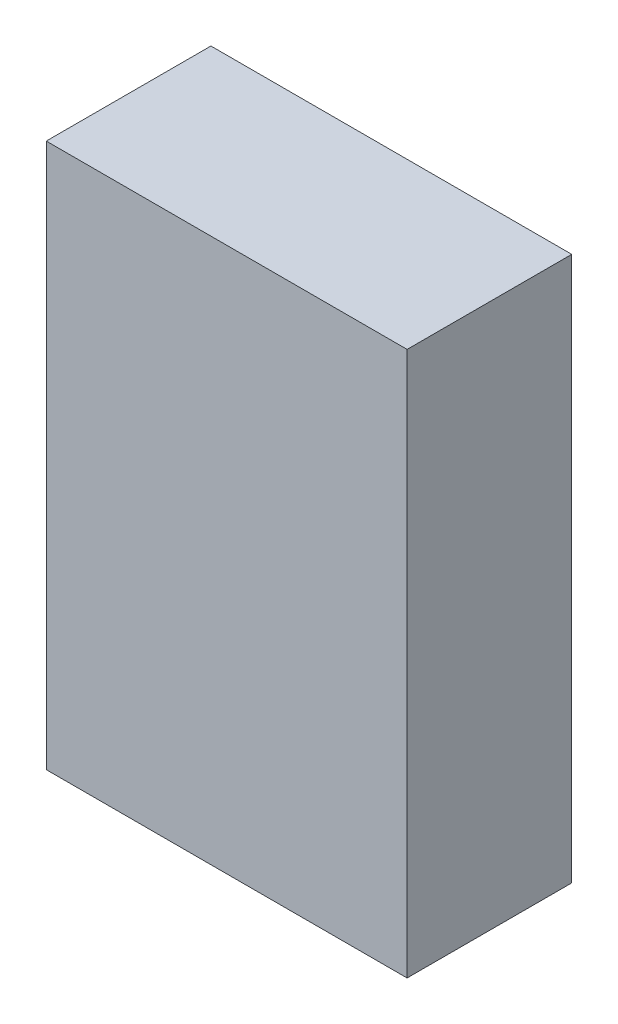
ISO-10303-21;
HEADER;
FILE_DESCRIPTION(('STEP AP214'),'2;1');
FILE_NAME('part.step','',(''),(''),'','','');
FILE_SCHEMA(('AUTOMOTIVE_DESIGN { 1 0 10303 214 1 1 1 1 }'));
ENDSEC;
DATA;
#1=APPLICATION_CONTEXT('core data for automotive mechanical design processes');
#2=APPLICATION_PROTOCOL_DEFINITION('international standard','automotive_design',2000,#1);
#3=PRODUCT_CONTEXT('',#1,'mechanical');
#4=PRODUCT('Part','Part','',(#3));
#5=PRODUCT_RELATED_PRODUCT_CATEGORY('part','',(#4));
#6=PRODUCT_DEFINITION_FORMATION('','',#4);
#7=PRODUCT_DEFINITION_CONTEXT('part definition',#1,'design');
#8=PRODUCT_DEFINITION('design','',#6,#7);
#9=PRODUCT_DEFINITION_SHAPE('','',#8);
#10=(LENGTH_UNIT() NAMED_UNIT(*) SI_UNIT(.MILLI.,.METRE.));
#11=(NAMED_UNIT(*) PLANE_ANGLE_UNIT() SI_UNIT($,.RADIAN.));
#12=(NAMED_UNIT(*) SI_UNIT($,.STERADIAN.) SOLID_ANGLE_UNIT());
#13=UNCERTAINTY_MEASURE_WITH_UNIT(LENGTH_MEASURE(1.E-05),#10,'distance_accuracy_value','');
#14=(GEOMETRIC_REPRESENTATION_CONTEXT(3) GLOBAL_UNCERTAINTY_ASSIGNED_CONTEXT((#13)) GLOBAL_UNIT_ASSIGNED_CONTEXT((#10,
#11,#12)) REPRESENTATION_CONTEXT('',''));
#15=CARTESIAN_POINT('',(0.,0.,0.));
#16=DIRECTION('',(0.,0.,1.));
#17=DIRECTION('',(1.,0.,0.));
#18=AXIS2_PLACEMENT_3D('',#15,#16,#17);
#19=CARTESIAN_POINT('',(-125.689752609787,-340.822154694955,-556.7));
#20=DIRECTION('',(-1.,0.,0.));
#21=DIRECTION('',(0.,0.,1.));
#22=AXIS2_PLACEMENT_3D('',#19,#20,#21);
#23=PLANE('',#22);
#24=DIRECTION('',(0.,-1.,0.));
#25=VECTOR('',#24,1.);
#26=CARTESIAN_POINT('',(-125.689752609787,-340.822154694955,0.));
#27=LINE('',#26,#25);
#28=CARTESIAN_POINT('',(-125.689752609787,1499.82657299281,0.));
#29=VERTEX_POINT('',#28);
#30=CARTESIAN_POINT('',(-125.689752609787,-340.822154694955,0.));
#31=VERTEX_POINT('',#30);
#32=EDGE_CURVE('E215',#29,#31,#27,.T.);
#33=ORIENTED_EDGE('',*,*,#32,.F.);
#34=DIRECTION('',(0.,0.,1.));
#35=VECTOR('',#34,1.);
#36=CARTESIAN_POINT('',(-125.689752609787,1499.82657299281,-556.7));
#37=LINE('',#36,#35);
#38=CARTESIAN_POINT('',(-125.689752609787,1499.82657299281,-556.7));
#39=VERTEX_POINT('',#38);
#40=EDGE_CURVE('E14',#39,#29,#37,.T.);
#41=ORIENTED_EDGE('',*,*,#40,.F.);
#42=DIRECTION('',(0.,-1.,0.));
#43=VECTOR('',#42,1.);
#44=CARTESIAN_POINT('',(-125.689752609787,-340.822154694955,-556.7));
#45=LINE('',#44,#43);
#46=CARTESIAN_POINT('',(-125.689752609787,-340.822154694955,-556.7));
#47=VERTEX_POINT('',#46);
#48=EDGE_CURVE('E217',#39,#47,#45,.T.);
#49=ORIENTED_EDGE('',*,*,#48,.T.);
#50=DIRECTION('',(0.,0.,1.));
#51=VECTOR('',#50,1.);
#52=CARTESIAN_POINT('',(-125.689752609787,-340.822154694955,-556.7));
#53=LINE('',#52,#51);
#54=EDGE_CURVE('E178',#47,#31,#53,.T.);
#55=ORIENTED_EDGE('',*,*,#54,.T.);
#56=EDGE_LOOP('',(#33,#41,#49,#55));
#57=FACE_BOUND('',#56,.T.);
#58=ADVANCED_FACE('F174',(#57),#23,.T.);
#59=CARTESIAN_POINT('',(-125.689752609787,1499.82657299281,-556.7));
#60=DIRECTION('',(0.,1.,0.));
#61=DIRECTION('',(0.,0.,1.));
#62=AXIS2_PLACEMENT_3D('',#59,#60,#61);
#63=PLANE('',#62);
#64=DIRECTION('',(-1.,0.,0.));
#65=VECTOR('',#64,1.);
#66=CARTESIAN_POINT('',(-125.689752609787,1499.82657299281,0.));
#67=LINE('',#66,#65);
#68=CARTESIAN_POINT('',(1094.33648617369,1499.82657299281,0.));
#69=VERTEX_POINT('',#68);
#70=EDGE_CURVE('E231',#69,#29,#67,.T.);
#71=ORIENTED_EDGE('',*,*,#70,.F.);
#72=DIRECTION('',(0.,0.,1.));
#73=VECTOR('',#72,1.);
#74=CARTESIAN_POINT('',(1094.33648617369,1499.82657299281,-556.7));
#75=LINE('',#74,#73);
#76=CARTESIAN_POINT('',(1094.33648617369,1499.82657299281,-556.7));
#77=VERTEX_POINT('',#76);
#78=EDGE_CURVE('E183',#77,#69,#75,.T.);
#79=ORIENTED_EDGE('',*,*,#78,.F.);
#80=DIRECTION('',(-1.,0.,0.));
#81=VECTOR('',#80,1.);
#82=CARTESIAN_POINT('',(-125.689752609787,1499.82657299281,-556.7));
#83=LINE('',#82,#81);
#84=EDGE_CURVE('E222',#77,#39,#83,.T.);
#85=ORIENTED_EDGE('',*,*,#84,.T.);
#86=ORIENTED_EDGE('',*,*,#40,.T.);
#87=EDGE_LOOP('',(#71,#79,#85,#86));
#88=FACE_BOUND('',#87,.T.);
#89=ADVANCED_FACE('F246',(#88),#63,.T.);
#90=CARTESIAN_POINT('',(1094.33648617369,-340.822154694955,-556.7));
#91=DIRECTION('',(1.,0.,0.));
#92=DIRECTION('',(0.,0.,-1.));
#93=AXIS2_PLACEMENT_3D('',#90,#91,#92);
#94=PLANE('',#93);
#95=DIRECTION('',(0.,1.,0.));
#96=VECTOR('',#95,1.);
#97=CARTESIAN_POINT('',(1094.33648617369,-340.822154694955,0.));
#98=LINE('',#97,#96);
#99=CARTESIAN_POINT('',(1094.33648617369,-340.822154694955,0.));
#100=VERTEX_POINT('',#99);
#101=EDGE_CURVE('E229',#100,#69,#98,.T.);
#102=ORIENTED_EDGE('',*,*,#101,.F.);
#103=DIRECTION('',(0.,0.,1.));
#104=VECTOR('',#103,1.);
#105=CARTESIAN_POINT('',(1094.33648617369,-340.822154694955,-556.7));
#106=LINE('',#105,#104);
#107=CARTESIAN_POINT('',(1094.33648617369,-340.822154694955,-556.7));
#108=VERTEX_POINT('',#107);
#109=EDGE_CURVE('E221',#108,#100,#106,.T.);
#110=ORIENTED_EDGE('',*,*,#109,.F.);
#111=DIRECTION('',(0.,1.,0.));
#112=VECTOR('',#111,1.);
#113=CARTESIAN_POINT('',(1094.33648617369,-340.822154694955,-556.7));
#114=LINE('',#113,#112);
#115=EDGE_CURVE('E239',#108,#77,#114,.T.);
#116=ORIENTED_EDGE('',*,*,#115,.T.);
#117=ORIENTED_EDGE('',*,*,#78,.T.);
#118=EDGE_LOOP('',(#102,#110,#116,#117));
#119=FACE_BOUND('',#118,.T.);
#120=ADVANCED_FACE('F243',(#119),#94,.T.);
#121=CARTESIAN_POINT('',(-125.689752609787,-340.822154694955,-556.7));
#122=DIRECTION('',(0.,-1.,0.));
#123=DIRECTION('',(0.,0.,-1.));
#124=AXIS2_PLACEMENT_3D('',#121,#122,#123);
#125=PLANE('',#124);
#126=DIRECTION('',(1.,0.,0.));
#127=VECTOR('',#126,1.);
#128=CARTESIAN_POINT('',(-125.689752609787,-340.822154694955,0.));
#129=LINE('',#128,#127);
#130=EDGE_CURVE('E224',#31,#100,#129,.T.);
#131=ORIENTED_EDGE('',*,*,#130,.F.);
#132=ORIENTED_EDGE('',*,*,#54,.F.);
#133=DIRECTION('',(1.,0.,0.));
#134=VECTOR('',#133,1.);
#135=CARTESIAN_POINT('',(-125.689752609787,-340.822154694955,-556.7));
#136=LINE('',#135,#134);
#137=EDGE_CURVE('E237',#47,#108,#136,.T.);
#138=ORIENTED_EDGE('',*,*,#137,.T.);
#139=ORIENTED_EDGE('',*,*,#109,.T.);
#140=EDGE_LOOP('',(#131,#132,#138,#139));
#141=FACE_BOUND('',#140,.T.);
#142=ADVANCED_FACE('F225',(#141),#125,.T.);
#143=CARTESIAN_POINT('',(-125.689752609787,1499.82657299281,-556.7));
#144=DIRECTION('',(0.,0.,-1.));
#145=DIRECTION('',(-1.,0.,0.));
#146=AXIS2_PLACEMENT_3D('',#143,#144,#145);
#147=PLANE('',#146);
#148=ORIENTED_EDGE('',*,*,#48,.F.);
#149=ORIENTED_EDGE('',*,*,#84,.F.);
#150=ORIENTED_EDGE('',*,*,#115,.F.);
#151=ORIENTED_EDGE('',*,*,#137,.F.);
#152=EDGE_LOOP('',(#148,#149,#150,#151));
#153=FACE_BOUND('',#152,.T.);
#154=ADVANCED_FACE('F248',(#153),#147,.T.);
#155=CARTESIAN_POINT('',(866.,5.99999999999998,-3.36536354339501E-13));
#156=DIRECTION('',(0.,0.,1.));
#157=DIRECTION('',(1.,0.,0.));
#158=AXIS2_PLACEMENT_3D('',#155,#156,#157);
#159=PLANE('',#158);
#160=ORIENTED_EDGE('',*,*,#32,.T.);
#161=ORIENTED_EDGE('',*,*,#130,.T.);
#162=ORIENTED_EDGE('',*,*,#101,.T.);
#163=ORIENTED_EDGE('',*,*,#70,.T.);
#164=EDGE_LOOP('',(#160,#161,#162,#163));
#165=FACE_BOUND('',#164,.T.);
#166=ADVANCED_FACE('F176',(#165),#159,.T.);
#167=CLOSED_SHELL('',(#58,#89,#120,#142,#154,#166));
#168=MANIFOLD_SOLID_BREP('B2',#167);
#169=ADVANCED_BREP_SHAPE_REPRESENTATION('',(#18,#168),#14);
#170=SHAPE_DEFINITION_REPRESENTATION(#9,#169);
ENDSEC;
END-ISO-10303-21;
